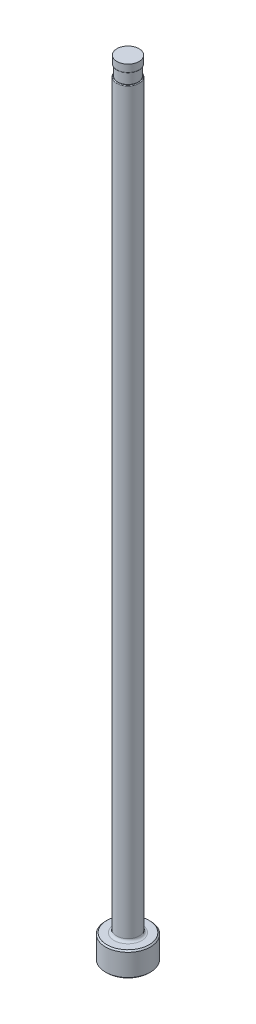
ISO-10303-21;
HEADER;
FILE_DESCRIPTION(('STEP AP214'),'2;1');
FILE_NAME('part.step','',(''),(''),'','','');
FILE_SCHEMA(('AUTOMOTIVE_DESIGN { 1 0 10303 214 1 1 1 1 }'));
ENDSEC;
DATA;
#1=APPLICATION_CONTEXT('core data for automotive mechanical design processes');
#2=APPLICATION_PROTOCOL_DEFINITION('international standard','automotive_design',2000,#1);
#3=PRODUCT_CONTEXT('',#1,'mechanical');
#4=PRODUCT('Part','Part','',(#3));
#5=PRODUCT_RELATED_PRODUCT_CATEGORY('part','',(#4));
#6=PRODUCT_DEFINITION_FORMATION('','',#4);
#7=PRODUCT_DEFINITION_CONTEXT('part definition',#1,'design');
#8=PRODUCT_DEFINITION('design','',#6,#7);
#9=PRODUCT_DEFINITION_SHAPE('','',#8);
#10=(LENGTH_UNIT() NAMED_UNIT(*) SI_UNIT(.MILLI.,.METRE.));
#11=(NAMED_UNIT(*) PLANE_ANGLE_UNIT() SI_UNIT($,.RADIAN.));
#12=(NAMED_UNIT(*) SI_UNIT($,.STERADIAN.) SOLID_ANGLE_UNIT());
#13=UNCERTAINTY_MEASURE_WITH_UNIT(LENGTH_MEASURE(1.E-05),#10,'distance_accuracy_value','');
#14=(GEOMETRIC_REPRESENTATION_CONTEXT(3) GLOBAL_UNCERTAINTY_ASSIGNED_CONTEXT((#13)) GLOBAL_UNIT_ASSIGNED_CONTEXT((#10,
#11,#12)) REPRESENTATION_CONTEXT('',''));
#15=CARTESIAN_POINT('',(0.,0.,0.));
#16=DIRECTION('',(0.,0.,1.));
#17=DIRECTION('',(1.,0.,0.));
#18=AXIS2_PLACEMENT_3D('',#15,#16,#17);
#19=CARTESIAN_POINT('',(-2.18185999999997,150.876,0.));
#20=DIRECTION('',(0.,1.,0.));
#21=DIRECTION('',(0.,0.,1.));
#22=AXIS2_PLACEMENT_3D('',#19,#20,#21);
#23=PLANE('',#22);
#24=CARTESIAN_POINT('',(0.,150.876,0.));
#25=DIRECTION('',(0.,1.,0.));
#26=DIRECTION('',(0.,0.,1.));
#27=AXIS2_PLACEMENT_3D('',#24,#25,#26);
#28=CIRCLE('',#27,2.02945999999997);
#29=CARTESIAN_POINT('',(0.,150.876,2.02945999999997));
#30=VERTEX_POINT('',#29);
#31=EDGE_CURVE('E11',#30,#30,#28,.F.);
#32=ORIENTED_EDGE('',*,*,#31,.T.);
#33=EDGE_LOOP('',(#32));
#34=FACE_BOUND('',#33,.T.);
#35=CARTESIAN_POINT('',(0.,150.876,0.));
#36=DIRECTION('',(0.,1.,0.));
#37=DIRECTION('',(0.,0.,1.));
#38=AXIS2_PLACEMENT_3D('',#35,#36,#37);
#39=CIRCLE('',#38,1.97865999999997);
#40=CARTESIAN_POINT('',(0.,150.876,1.97865999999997));
#41=VERTEX_POINT('',#40);
#42=EDGE_CURVE('E78',#41,#41,#39,.T.);
#43=ORIENTED_EDGE('',*,*,#42,.T.);
#44=EDGE_LOOP('',(#43));
#45=FACE_BOUND('',#44,.T.);
#46=ADVANCED_FACE('F36',(#34,#45),#23,.F.);
#47=CARTESIAN_POINT('',(0.,259.958771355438,0.));
#48=DIRECTION('',(0.,1.,0.));
#49=DIRECTION('',(0.,0.,1.));
#50=AXIS2_PLACEMENT_3D('',#47,#48,#49);
#51=CYLINDRICAL_SURFACE('',#50,2.18185999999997);
#52=DIRECTION('',(0.,1.,0.));
#53=VECTOR('',#52,1.);
#54=CARTESIAN_POINT('',(-1.97865999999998,259.958771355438,-0.919465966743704));
#55=LINE('',#54,#53);
#56=CARTESIAN_POINT('',(-1.97865999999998,148.717,-0.919465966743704));
#57=VERTEX_POINT('',#56);
#58=CARTESIAN_POINT('',(-1.97865999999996,86.36,-0.919465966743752));
#59=VERTEX_POINT('',#58);
#60=EDGE_CURVE('E73',#57,#59,#55,.F.);
#61=ORIENTED_EDGE('',*,*,#60,.F.);
#62=CARTESIAN_POINT('',(0.,148.717,0.));
#63=DIRECTION('',(0.,-1.,0.));
#64=DIRECTION('',(0.,0.,-1.));
#65=AXIS2_PLACEMENT_3D('',#62,#63,#64);
#66=CIRCLE('',#65,2.18185999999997);
#67=CARTESIAN_POINT('',(-1.97865999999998,148.717,0.919465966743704));
#68=VERTEX_POINT('',#67);
#69=EDGE_CURVE('E51',#57,#68,#66,.T.);
#70=ORIENTED_EDGE('',*,*,#69,.T.);
#71=DIRECTION('',(0.,1.,0.));
#72=VECTOR('',#71,1.);
#73=CARTESIAN_POINT('',(-1.97865999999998,259.958771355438,0.919465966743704));
#74=LINE('',#73,#72);
#75=CARTESIAN_POINT('',(-1.97865999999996,86.36,0.919465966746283));
#76=VERTEX_POINT('',#75);
#77=EDGE_CURVE('E84',#76,#68,#74,.T.);
#78=ORIENTED_EDGE('',*,*,#77,.F.);
#79=CARTESIAN_POINT('',(-1.97865999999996,86.36,-0.919465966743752));
#80=CARTESIAN_POINT('',(-1.97865866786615,86.3286405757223,-0.919462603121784));
#81=CARTESIAN_POINT('',(-1.97912506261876,86.2972918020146,-0.918466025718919));
#82=CARTESIAN_POINT('',(-1.98097751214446,86.2347428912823,-0.914466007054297));
#83=CARTESIAN_POINT('',(-1.98236377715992,86.2035427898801,-0.911462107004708));
#84=CARTESIAN_POINT('',(-1.98789143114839,86.1101571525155,-0.899380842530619));
#85=CARTESIAN_POINT('',(-1.99340148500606,86.048411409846,-0.887233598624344));
#86=CARTESIAN_POINT('',(-2.00766626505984,85.9274900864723,-0.854463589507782));
#87=CARTESIAN_POINT('',(-2.01642631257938,85.8683188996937,-0.833826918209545));
#88=CARTESIAN_POINT('',(-2.03642611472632,85.7543500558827,-0.783714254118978));
#89=CARTESIAN_POINT('',(-2.04766149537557,85.6995449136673,-0.754253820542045));
#90=CARTESIAN_POINT('',(-2.06976532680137,85.6034949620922,-0.691040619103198));
#91=CARTESIAN_POINT('',(-2.08046172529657,85.5614280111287,-0.658480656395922));
#92=CARTESIAN_POINT('',(-2.10182499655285,85.483320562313,-0.586722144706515));
#93=CARTESIAN_POINT('',(-2.11249187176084,85.4472795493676,-0.547524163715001));
#94=CARTESIAN_POINT('',(-2.13268121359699,85.3825154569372,-0.4627024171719));
#95=CARTESIAN_POINT('',(-2.14219477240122,85.3538476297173,-0.417033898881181));
#96=CARTESIAN_POINT('',(-2.15871707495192,85.3056764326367,-0.320671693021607));
#97=CARTESIAN_POINT('',(-2.16572797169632,85.2861651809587,-0.269982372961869));
#98=CARTESIAN_POINT('',(-2.17552234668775,85.2593195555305,-0.172335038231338));
#99=CARTESIAN_POINT('',(-2.17874151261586,85.2507183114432,-0.125766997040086));
#100=CARTESIAN_POINT('',(-2.18213487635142,85.2416577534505,-0.0317428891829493));
#101=CARTESIAN_POINT('',(-2.18231070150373,85.2411940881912,0.0157126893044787));
#102=CARTESIAN_POINT('',(-2.17970850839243,85.2481335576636,0.106163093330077));
#103=CARTESIAN_POINT('',(-2.17716289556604,85.254917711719,0.149213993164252));
#104=CARTESIAN_POINT('',(-2.16974118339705,85.27511834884,0.233509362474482));
#105=CARTESIAN_POINT('',(-2.16486525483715,85.2885343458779,0.274753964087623));
#106=CARTESIAN_POINT('',(-2.15317272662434,85.3217261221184,0.355008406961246));
#107=CARTESIAN_POINT('',(-2.14632875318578,85.3415921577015,0.393976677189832));
#108=CARTESIAN_POINT('',(-2.13136233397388,85.38690710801,0.46823629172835));
#109=CARTESIAN_POINT('',(-2.12323947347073,85.4123578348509,0.50352643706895));
#110=CARTESIAN_POINT('',(-2.1056031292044,85.4706284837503,0.57302033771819));
#111=CARTESIAN_POINT('',(-2.09603057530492,85.5039136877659,0.606817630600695));
#112=CARTESIAN_POINT('',(-2.07698351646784,85.5751137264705,0.66911560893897));
#113=CARTESIAN_POINT('',(-2.0675090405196,85.6130298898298,0.6976147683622));
#114=CARTESIAN_POINT('',(-2.04798045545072,85.6985059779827,0.75318377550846));
#115=CARTESIAN_POINT('',(-2.03805488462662,85.7466575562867,0.779387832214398));
#116=CARTESIAN_POINT('',(-2.02005215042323,85.846471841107,0.824924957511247));
#117=CARTESIAN_POINT('',(-2.01197798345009,85.8981400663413,0.844246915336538));
#118=CARTESIAN_POINT('',(-1.99655433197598,86.0169127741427,0.880207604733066));
#119=CARTESIAN_POINT('',(-1.98987802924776,86.0846743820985,0.895000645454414));
#120=CARTESIAN_POINT('',(-1.98316702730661,86.1874162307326,0.909716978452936));
#121=CARTESIAN_POINT('',(-1.98148063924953,86.2218147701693,0.91337694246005));
#122=CARTESIAN_POINT('',(-1.97922666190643,86.2908033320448,0.918247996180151));
#123=CARTESIAN_POINT('',(-1.97865847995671,86.3253932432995,0.91946038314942));
#124=CARTESIAN_POINT('',(-1.97865999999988,86.3599999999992,0.919465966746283));
#125=B_SPLINE_CURVE_WITH_KNOTS('',3,(#79,#80,#81,#82,#83,#84,#85,#86,#87,#88,#89,#90,#91,#92,
#93,#94,#95,#96,#97,#98,#99,#100,#101,#102,#103,#104,#105,#106,#107,#108,#109,#110,#111,#112,
#113,#114,#115,#116,#117,#118,#119,#120,#121,#122,#123,#124),.UNSPECIFIED.,.F.,.F.,(4,2,2,2,2,2,
2,2,2,2,2,2,2,2,2,2,2,2,2,2,2,2,4),(0.,0.0940372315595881,0.188095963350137,0.376882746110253,
0.565980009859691,0.754745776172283,0.916867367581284,1.07897509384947,1.24226436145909,
1.40541281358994,1.54703759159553,1.68858663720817,1.8189460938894,1.94929599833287,
2.08155476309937,2.21385650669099,2.35846583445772,2.50311675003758,2.66961219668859,
2.83637523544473,3.04438491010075,3.1481998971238,3.25195984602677),.UNSPECIFIED.);
#126=EDGE_CURVE('E81',#59,#76,#125,.T.);
#127=ORIENTED_EDGE('',*,*,#126,.F.);
#128=EDGE_LOOP('',(#61,#70,#78,#127));
#129=FACE_BOUND('',#128,.T.);
#130=CARTESIAN_POINT('',(0.,5.25779999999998,0.));
#131=DIRECTION('',(0.,1.,0.));
#132=DIRECTION('',(0.,0.,1.));
#133=AXIS2_PLACEMENT_3D('',#130,#131,#132);
#134=CIRCLE('',#133,2.18185999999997);
#135=CARTESIAN_POINT('',(0.,5.25779999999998,2.18185999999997));
#136=VERTEX_POINT('',#135);
#137=EDGE_CURVE('E116',#136,#136,#134,.T.);
#138=ORIENTED_EDGE('',*,*,#137,.T.);
#139=EDGE_LOOP('',(#138));
#140=FACE_BOUND('',#139,.T.);
#141=ADVANCED_FACE('F82',(#129,#140),#51,.T.);
#142=CARTESIAN_POINT('',(0.,0.,0.));
#143=DIRECTION('',(0.,-1.,0.));
#144=DIRECTION('',(0.,0.,-1.));
#145=AXIS2_PLACEMENT_3D('',#142,#143,#144);
#146=PLANE('',#145);
#147=CARTESIAN_POINT('',(0.,0.,0.));
#148=DIRECTION('',(0.,-1.,0.));
#149=DIRECTION('',(0.,0.,-1.));
#150=AXIS2_PLACEMENT_3D('',#147,#148,#149);
#151=CIRCLE('',#150,4.10209999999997);
#152=CARTESIAN_POINT('',(0.,0.,-4.10209999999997));
#153=VERTEX_POINT('',#152);
#154=EDGE_CURVE('E113',#153,#153,#151,.T.);
#155=ORIENTED_EDGE('',*,*,#154,.T.);
#156=EDGE_LOOP('',(#155));
#157=FACE_BOUND('',#156,.T.);
#158=ADVANCED_FACE('F192',(#157),#146,.T.);
#159=CARTESIAN_POINT('',(0.,259.958771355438,0.));
#160=DIRECTION('',(0.,1.,0.));
#161=DIRECTION('',(0.,0.,1.));
#162=AXIS2_PLACEMENT_3D('',#159,#160,#161);
#163=CYLINDRICAL_SURFACE('',#162,4.35609999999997);
#164=CARTESIAN_POINT('',(0.,4.49580000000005,0.));
#165=DIRECTION('',(0.,1.,0.));
#166=DIRECTION('',(0.,0.,1.));
#167=AXIS2_PLACEMENT_3D('',#164,#165,#166);
#168=CIRCLE('',#167,4.35609999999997);
#169=CARTESIAN_POINT('',(0.,4.49580000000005,4.35609999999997));
#170=VERTEX_POINT('',#169);
#171=EDGE_CURVE('E110',#170,#170,#168,.F.);
#172=ORIENTED_EDGE('',*,*,#171,.T.);
#173=EDGE_LOOP('',(#172));
#174=FACE_BOUND('',#173,.T.);
#175=CARTESIAN_POINT('',(0.,0.253999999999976,0.));
#176=DIRECTION('',(0.,-1.,0.));
#177=DIRECTION('',(0.,0.,-1.));
#178=AXIS2_PLACEMENT_3D('',#175,#176,#177);
#179=CIRCLE('',#178,4.35609999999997);
#180=CARTESIAN_POINT('',(0.,0.253999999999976,-4.35609999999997));
#181=VERTEX_POINT('',#180);
#182=EDGE_CURVE('E107',#181,#181,#179,.F.);
#183=ORIENTED_EDGE('',*,*,#182,.T.);
#184=EDGE_LOOP('',(#183));
#185=FACE_BOUND('',#184,.T.);
#186=ADVANCED_FACE('F195',(#174,#185),#163,.T.);
#187=CARTESIAN_POINT('',(-4.35609999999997,4.7498,0.));
#188=DIRECTION('',(0.,1.,0.));
#189=DIRECTION('',(0.,0.,1.));
#190=AXIS2_PLACEMENT_3D('',#187,#188,#189);
#191=PLANE('',#190);
#192=CARTESIAN_POINT('',(0.,4.7498,0.));
#193=DIRECTION('',(0.,1.,0.));
#194=DIRECTION('',(0.,0.,1.));
#195=AXIS2_PLACEMENT_3D('',#192,#193,#194);
#196=CIRCLE('',#195,2.68985999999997);
#197=CARTESIAN_POINT('',(0.,4.7498,2.68985999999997));
#198=VERTEX_POINT('',#197);
#199=EDGE_CURVE('E87',#198,#198,#196,.F.);
#200=ORIENTED_EDGE('',*,*,#199,.T.);
#201=EDGE_LOOP('',(#200));
#202=FACE_BOUND('',#201,.T.);
#203=CARTESIAN_POINT('',(0.,4.7498,0.));
#204=DIRECTION('',(0.,1.,0.));
#205=DIRECTION('',(0.,0.,1.));
#206=AXIS2_PLACEMENT_3D('',#203,#204,#205);
#207=CIRCLE('',#206,4.10210000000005);
#208=CARTESIAN_POINT('',(0.,4.7498,4.10210000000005));
#209=VERTEX_POINT('',#208);
#210=EDGE_CURVE('E104',#209,#209,#207,.T.);
#211=ORIENTED_EDGE('',*,*,#210,.T.);
#212=EDGE_LOOP('',(#211));
#213=FACE_BOUND('',#212,.T.);
#214=ADVANCED_FACE('F190',(#202,#213),#191,.T.);
#215=CARTESIAN_POINT('',(0.,4.74980000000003,0.));
#216=DIRECTION('',(0.,-1.,0.));
#217=DIRECTION('',(0.,0.,-1.));
#218=AXIS2_PLACEMENT_3D('',#215,#216,#217);
#219=CONICAL_SURFACE('',#218,4.10210000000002,0.785398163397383);
#220=ORIENTED_EDGE('',*,*,#171,.F.);
#221=EDGE_LOOP('',(#220));
#222=FACE_BOUND('',#221,.T.);
#223=ORIENTED_EDGE('',*,*,#210,.F.);
#224=EDGE_LOOP('',(#223));
#225=FACE_BOUND('',#224,.T.);
#226=ADVANCED_FACE('F186',(#222,#225),#219,.T.);
#227=CARTESIAN_POINT('',(0.,0.253999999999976,0.));
#228=DIRECTION('',(0.,1.,0.));
#229=DIRECTION('',(0.,0.,1.));
#230=AXIS2_PLACEMENT_3D('',#227,#228,#229);
#231=CONICAL_SURFACE('',#230,4.35609999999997,0.785398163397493);
#232=ORIENTED_EDGE('',*,*,#154,.F.);
#233=EDGE_LOOP('',(#232));
#234=FACE_BOUND('',#233,.T.);
#235=ORIENTED_EDGE('',*,*,#182,.F.);
#236=EDGE_LOOP('',(#235));
#237=FACE_BOUND('',#236,.T.);
#238=ADVANCED_FACE('F182',(#234,#237),#231,.T.);
#239=CARTESIAN_POINT('',(0.,5.25779999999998,0.));
#240=DIRECTION('',(0.,1.,0.));
#241=DIRECTION('',(0.,0.,1.));
#242=AXIS2_PLACEMENT_3D('',#239,#240,#241);
#243=TOROIDAL_SURFACE('',#242,2.68985999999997,0.508);
#244=ORIENTED_EDGE('',*,*,#199,.F.);
#245=EDGE_LOOP('',(#244));
#246=FACE_BOUND('',#245,.T.);
#247=ORIENTED_EDGE('',*,*,#137,.F.);
#248=EDGE_LOOP('',(#247));
#249=FACE_BOUND('',#248,.T.);
#250=ADVANCED_FACE('F147',(#246,#249),#243,.F.);
#251=CARTESIAN_POINT('',(-2.18185999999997,148.844,0.));
#252=DIRECTION('',(0.,-1.,0.));
#253=DIRECTION('',(0.,0.,-1.));
#254=AXIS2_PLACEMENT_3D('',#251,#252,#253);
#255=PLANE('',#254);
#256=DIRECTION('',(0.,0.,1.));
#257=VECTOR('',#256,1.);
#258=CARTESIAN_POINT('',(-1.97865999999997,148.844,0.));
#259=LINE('',#258,#257);
#260=CARTESIAN_POINT('',(-1.97865999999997,148.844,0.));
#261=VERTEX_POINT('',#260);
#262=CARTESIAN_POINT('',(-1.97865999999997,148.844,0.554395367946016));
#263=VERTEX_POINT('',#262);
#264=EDGE_CURVE('E90',#261,#263,#259,.T.);
#265=ORIENTED_EDGE('',*,*,#264,.T.);
#266=CARTESIAN_POINT('',(0.,148.844,0.));
#267=DIRECTION('',(0.,-1.,0.));
#268=DIRECTION('',(0.,0.,-1.));
#269=AXIS2_PLACEMENT_3D('',#266,#267,#268);
#270=CIRCLE('',#269,2.05485999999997);
#271=CARTESIAN_POINT('',(-1.97865999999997,148.844,-0.554395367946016));
#272=VERTEX_POINT('',#271);
#273=EDGE_CURVE('E86',#263,#272,#270,.F.);
#274=ORIENTED_EDGE('',*,*,#273,.T.);
#275=EDGE_CURVE('E79',#272,#261,#259,.T.);
#276=ORIENTED_EDGE('',*,*,#275,.T.);
#277=CARTESIAN_POINT('',(0.,148.844,0.));
#278=DIRECTION('',(0.,1.,0.));
#279=DIRECTION('',(0.,0.,1.));
#280=AXIS2_PLACEMENT_3D('',#277,#278,#279);
#281=CIRCLE('',#280,1.97865999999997);
#282=EDGE_CURVE('E101',#261,#261,#281,.T.);
#283=ORIENTED_EDGE('',*,*,#282,.F.);
#284=EDGE_LOOP('',(#265,#274,#276,#283));
#285=FACE_BOUND('',#284,.T.);
#286=ADVANCED_FACE('F144',(#285),#255,.F.);
#287=CARTESIAN_POINT('',(0.,153.448281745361,0.));
#288=DIRECTION('',(0.,1.,0.));
#289=DIRECTION('',(0.,0.,1.));
#290=AXIS2_PLACEMENT_3D('',#287,#288,#289);
#291=CYLINDRICAL_SURFACE('',#290,1.97865999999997);
#292=ORIENTED_EDGE('',*,*,#42,.F.);
#293=EDGE_LOOP('',(#292));
#294=FACE_BOUND('',#293,.T.);
#295=ORIENTED_EDGE('',*,*,#282,.T.);
#296=EDGE_LOOP('',(#295));
#297=FACE_BOUND('',#296,.T.);
#298=ADVANCED_FACE('F141',(#294,#297),#291,.T.);
#299=CARTESIAN_POINT('',(-1.97865999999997,149.86,-4.35609999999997));
#300=DIRECTION('',(1.,0.,0.));
#301=DIRECTION('',(0.,1.,0.));
#302=AXIS2_PLACEMENT_3D('',#299,#300,#301);
#303=PLANE('',#302);
#304=ORIENTED_EDGE('',*,*,#275,.F.);
#305=CARTESIAN_POINT('',(-1.97865999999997,148.844,-0.554395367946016));
#306=CARTESIAN_POINT('',(-1.97865999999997,148.843980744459,-0.575592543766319));
#307=CARTESIAN_POINT('',(-1.97865999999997,148.843610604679,-0.59681069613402));
#308=CARTESIAN_POINT('',(-1.97865999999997,148.841797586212,-0.639399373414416));
#309=CARTESIAN_POINT('',(-1.97865999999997,148.840344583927,-0.660769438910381));
#310=CARTESIAN_POINT('',(-1.97865999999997,148.835969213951,-0.703485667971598));
#311=CARTESIAN_POINT('',(-1.97865999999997,148.833038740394,-0.724831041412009));
#312=CARTESIAN_POINT('',(-1.97865999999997,148.825100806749,-0.767087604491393));
#313=CARTESIAN_POINT('',(-1.97865999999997,148.820102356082,-0.788000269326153));
#314=CARTESIAN_POINT('',(-1.97865999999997,148.811075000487,-0.815870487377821));
#315=CARTESIAN_POINT('',(-1.97865999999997,148.808437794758,-0.823276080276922));
#316=CARTESIAN_POINT('',(-1.97865999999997,148.80261239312,-0.837911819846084));
#317=CARTESIAN_POINT('',(-1.97865999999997,148.799421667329,-0.845140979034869));
#318=CARTESIAN_POINT('',(-1.97865999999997,148.791442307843,-0.861139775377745));
#319=CARTESIAN_POINT('',(-1.97865999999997,148.786454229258,-0.869811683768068));
#320=CARTESIAN_POINT('',(-1.97865999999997,148.775037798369,-0.886141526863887));
#321=CARTESIAN_POINT('',(-1.97865999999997,148.768621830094,-0.893807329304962));
#322=CARTESIAN_POINT('',(-1.97865999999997,148.758411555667,-0.902964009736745));
#323=CARTESIAN_POINT('',(-1.97865999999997,148.75543102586,-0.905353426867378));
#324=CARTESIAN_POINT('',(-1.97865999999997,148.749163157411,-0.909703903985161));
#325=CARTESIAN_POINT('',(-1.97865999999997,148.745875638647,-0.911664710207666));
#326=CARTESIAN_POINT('',(-1.97865999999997,148.738965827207,-0.915035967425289));
#327=CARTESIAN_POINT('',(-1.97865999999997,148.735339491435,-0.916438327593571));
#328=CARTESIAN_POINT('',(-1.97865999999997,148.727884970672,-0.918487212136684));
#329=CARTESIAN_POINT('',(-1.97865999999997,148.724057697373,-0.919136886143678));
#330=CARTESIAN_POINT('',(-1.97865999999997,148.71914216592,-0.91943429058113));
#331=CARTESIAN_POINT('',(-1.97865999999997,148.718070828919,-0.919466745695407));
#332=CARTESIAN_POINT('',(-1.97865999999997,148.717,-0.919465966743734));
#333=B_SPLINE_CURVE_WITH_KNOTS('',3,(#305,#306,#307,#308,#309,#310,#311,#312,#313,#314,#315,
#316,#317,#318,#319,#320,#321,#322,#323,#324,#325,#326,#327,#328,#329,#330,#331,#332),
.UNSPECIFIED.,.F.,.F.,(4,2,2,2,2,2,2,2,2,2,2,2,2,4),(0.,0.0636224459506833,0.127847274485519,
0.192428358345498,0.256731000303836,0.280298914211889,0.30397752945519,0.333913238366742,
0.363598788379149,0.375030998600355,0.386469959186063,0.398069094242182,0.409619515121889,
0.412833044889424),.UNSPECIFIED.);
#334=EDGE_CURVE('E59',#272,#57,#333,.T.);
#335=ORIENTED_EDGE('',*,*,#334,.T.);
#336=ORIENTED_EDGE('',*,*,#60,.T.);
#337=DIRECTION('',(0.,0.,1.));
#338=VECTOR('',#337,1.);
#339=CARTESIAN_POINT('',(-1.97865999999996,86.36,-4.35609999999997));
#340=LINE('',#339,#338);
#341=EDGE_CURVE('E77',#59,#76,#340,.T.);
#342=ORIENTED_EDGE('',*,*,#341,.T.);
#343=ORIENTED_EDGE('',*,*,#77,.T.);
#344=CARTESIAN_POINT('',(-1.97865999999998,148.717,0.919465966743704));
#345=CARTESIAN_POINT('',(-1.97865999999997,148.720299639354,0.919474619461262));
#346=CARTESIAN_POINT('',(-1.97865999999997,148.723588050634,0.919161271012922));
#347=CARTESIAN_POINT('',(-1.97865999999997,148.730024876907,0.917970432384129));
#348=CARTESIAN_POINT('',(-1.97865999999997,148.733174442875,0.917099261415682));
#349=CARTESIAN_POINT('',(-1.97865999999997,148.740004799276,0.914610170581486));
#350=CARTESIAN_POINT('',(-1.97865999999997,148.743638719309,0.912865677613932));
#351=CARTESIAN_POINT('',(-1.97865999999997,148.750587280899,0.908811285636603));
#352=CARTESIAN_POINT('',(-1.97865999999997,148.753900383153,0.906498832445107));
#353=CARTESIAN_POINT('',(-1.97865999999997,148.762031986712,0.899998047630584));
#354=CARTESIAN_POINT('',(-1.97865999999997,148.766602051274,0.895502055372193));
#355=CARTESIAN_POINT('',(-1.97865999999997,148.775028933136,0.885897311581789));
#356=CARTESIAN_POINT('',(-1.97865999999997,148.778884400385,0.880787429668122));
#357=CARTESIAN_POINT('',(-1.97865999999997,148.789507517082,0.865009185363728));
#358=CARTESIAN_POINT('',(-1.97865999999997,148.795441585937,0.853786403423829));
#359=CARTESIAN_POINT('',(-1.97865999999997,148.805811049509,0.830611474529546));
#360=CARTESIAN_POINT('',(-1.97865999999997,148.810233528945,0.818654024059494));
#361=CARTESIAN_POINT('',(-1.97865999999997,148.820746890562,0.78564376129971));
#362=CARTESIAN_POINT('',(-1.97865999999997,148.825742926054,0.764247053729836));
#363=CARTESIAN_POINT('',(-1.97865999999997,148.833629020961,0.721022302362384));
#364=CARTESIAN_POINT('',(-1.97865999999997,148.836509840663,0.69919278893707));
#365=CARTESIAN_POINT('',(-1.97865999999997,148.840633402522,0.656787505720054));
#366=CARTESIAN_POINT('',(-1.97865999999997,148.841968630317,0.636220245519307));
#367=CARTESIAN_POINT('',(-1.97865999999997,148.843639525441,0.595227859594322));
#368=CARTESIAN_POINT('',(-1.97865999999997,148.843984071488,0.574803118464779));
#369=CARTESIAN_POINT('',(-1.97865999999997,148.844,0.55439536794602));
#370=B_SPLINE_CURVE_WITH_KNOTS('',3,(#344,#345,#346,#347,#348,#349,#350,#351,#352,#353,#354,
#355,#356,#357,#358,#359,#360,#361,#362,#363,#364,#365,#366,#367,#368,#369),.UNSPECIFIED.,.F.,
.F.,(4,2,2,2,2,2,2,2,2,2,2,2,4),(0.,0.00986593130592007,0.0196220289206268,0.0316477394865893,
0.0437285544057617,0.0628524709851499,0.0820121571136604,0.119885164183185,0.158074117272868,
0.223787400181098,0.289786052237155,0.351589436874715,0.412837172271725),.UNSPECIFIED.);
#371=EDGE_CURVE('E172',#68,#263,#370,.T.);
#372=ORIENTED_EDGE('',*,*,#371,.T.);
#373=ORIENTED_EDGE('',*,*,#264,.F.);
#374=EDGE_LOOP('',(#304,#335,#336,#342,#343,#372,#373));
#375=FACE_BOUND('',#374,.T.);
#376=ADVANCED_FACE('F75',(#375),#303,.F.);
#377=CARTESIAN_POINT('',(-5.15365999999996,86.36,-4.35609999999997));
#378=DIRECTION('',(0.,0.,1.));
#379=DIRECTION('',(1.,0.,0.));
#380=AXIS2_PLACEMENT_3D('',#377,#378,#379);
#381=CYLINDRICAL_SURFACE('',#380,3.175);
#382=ORIENTED_EDGE('',*,*,#341,.F.);
#383=ORIENTED_EDGE('',*,*,#126,.T.);
#384=EDGE_LOOP('',(#382,#383));
#385=FACE_BOUND('',#384,.T.);
#386=ADVANCED_FACE('F89',(#385),#381,.F.);
#387=CARTESIAN_POINT('',(0.,152.687735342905,0.));
#388=DIRECTION('',(0.,1.,0.));
#389=DIRECTION('',(0.,0.,1.));
#390=AXIS2_PLACEMENT_3D('',#387,#388,#389);
#391=CYLINDRICAL_SURFACE('',#390,2.15645999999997);
#392=CARTESIAN_POINT('',(0.,151.003,0.));
#393=DIRECTION('',(0.,1.,0.));
#394=DIRECTION('',(0.,0.,1.));
#395=AXIS2_PLACEMENT_3D('',#392,#393,#394);
#396=CIRCLE('',#395,2.15645999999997);
#397=CARTESIAN_POINT('',(0.,151.003,2.15645999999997));
#398=VERTEX_POINT('',#397);
#399=EDGE_CURVE('E44',#398,#398,#396,.T.);
#400=ORIENTED_EDGE('',*,*,#399,.T.);
#401=EDGE_LOOP('',(#400));
#402=FACE_BOUND('',#401,.T.);
#403=CARTESIAN_POINT('',(0.,152.4,0.));
#404=DIRECTION('',(0.,1.,0.));
#405=DIRECTION('',(0.,0.,1.));
#406=AXIS2_PLACEMENT_3D('',#403,#404,#405);
#407=CIRCLE('',#406,2.15645999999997);
#408=CARTESIAN_POINT('',(0.,152.4,2.15645999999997));
#409=VERTEX_POINT('',#408);
#410=EDGE_CURVE('E91',#409,#409,#407,.T.);
#411=ORIENTED_EDGE('',*,*,#410,.F.);
#412=EDGE_LOOP('',(#411));
#413=FACE_BOUND('',#412,.T.);
#414=ADVANCED_FACE('F135',(#402,#413),#391,.T.);
#415=CARTESIAN_POINT('',(-2.18185999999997,152.4,0.));
#416=DIRECTION('',(0.,1.,0.));
#417=DIRECTION('',(0.,0.,1.));
#418=AXIS2_PLACEMENT_3D('',#415,#416,#417);
#419=PLANE('',#418);
#420=ORIENTED_EDGE('',*,*,#410,.T.);
#421=EDGE_LOOP('',(#420));
#422=FACE_BOUND('',#421,.T.);
#423=ADVANCED_FACE('F149',(#422),#419,.T.);
#424=CARTESIAN_POINT('',(0.,148.717,0.));
#425=DIRECTION('',(0.,-1.,0.));
#426=DIRECTION('',(0.,0.,-1.));
#427=AXIS2_PLACEMENT_3D('',#424,#425,#426);
#428=TOROIDAL_SURFACE('',#427,2.05485999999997,0.127);
#429=ORIENTED_EDGE('',*,*,#371,.F.);
#430=ORIENTED_EDGE('',*,*,#69,.F.);
#431=ORIENTED_EDGE('',*,*,#334,.F.);
#432=ORIENTED_EDGE('',*,*,#273,.F.);
#433=EDGE_LOOP('',(#429,#430,#431,#432));
#434=FACE_BOUND('',#433,.T.);
#435=ADVANCED_FACE('F151',(#434),#428,.T.);
#436=CARTESIAN_POINT('',(0.,151.003,0.));
#437=DIRECTION('',(0.,1.,0.));
#438=DIRECTION('',(0.,0.,1.));
#439=AXIS2_PLACEMENT_3D('',#436,#437,#438);
#440=TOROIDAL_SURFACE('',#439,2.02945999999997,0.127);
#441=ORIENTED_EDGE('',*,*,#31,.F.);
#442=EDGE_LOOP('',(#441));
#443=FACE_BOUND('',#442,.T.);
#444=ORIENTED_EDGE('',*,*,#399,.F.);
#445=EDGE_LOOP('',(#444));
#446=FACE_BOUND('',#445,.T.);
#447=ADVANCED_FACE('F38',(#443,#446),#440,.T.);
#448=CLOSED_SHELL('',(#46,#141,#158,#186,#214,#226,#238,#250,#286,#298,#376,#386,#414,#423,#435,#447));
#449=MANIFOLD_SOLID_BREP('B2',#448);
#450=ADVANCED_BREP_SHAPE_REPRESENTATION('',(#18,#449),#14);
#451=SHAPE_DEFINITION_REPRESENTATION(#9,#450);
ENDSEC;
END-ISO-10303-21;
